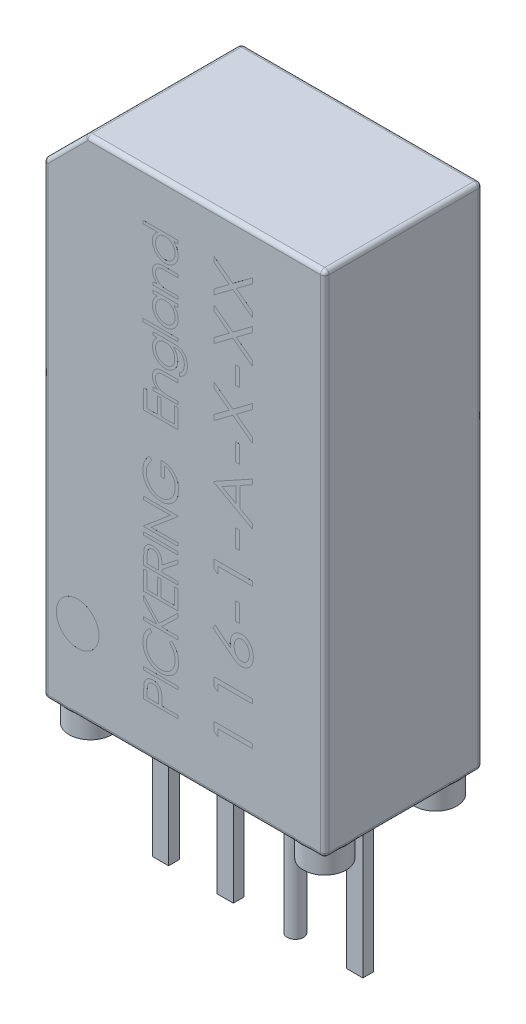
from build123d import *

# Parameters (mm, degrees)
SKETCH1_W           = 6.6
SKETCH1_H           = 3.7
MAIN_BODY_DEPTH     = 11.942
BOX_STYLE_CUT_DEPTH = 13.930249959
SKETCH3_R           = 0.5
FEET_DEPTH          = 0.508
SKETCH4_R           = 0.1905
SKETCH4_W           = 0.381
SKETCH4_H           = 0.254
PINS_DEPTH          = 3.678
SKETCH5_R           = 0.5
SKETCH5_W           = 0.8
SKETCH5_H           = 0.071794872
SKETCH5_W_2         = 0.820512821
SKETCH5_W_3         = 0.092307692
SKETCH5_H_2         = 0.415384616
SKETCH5_H_3         = 0.415384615
LETTERING_DEPTH     = 0.0001
FILLET1_R           = 0.1


with BuildPart() as part:
    # Sketch1 → Main body (new body)
    with BuildSketch(Plane(origin=(0, 0, 0), x_dir=(1, 0, 0), z_dir=(0, 1, 0))):
        Rectangle(SKETCH1_W, SKETCH1_H)
    extrude(amount=MAIN_BODY_DEPTH)

    # Sketch2 → Box style cut (cut, through all)
    with BuildSketch(Plane.XY.offset(1.85)):
        Polygon((-2.3, 11.942), (-3.3, 10.942), (-3.3, 11.942), align=None)
    extrude(amount=-BOX_STYLE_CUT_DEPTH, mode=Mode.SUBTRACT)

    # Sketch3 → Feet (add)
    with BuildSketch(Plane.XZ):
        with Locations(Location((-2.75, 1.3, 0), (0, 0, 90))):
            Circle(SKETCH3_R)
        with Locations(Location((-2.75, -1.3, 0), (0, 0, 90))):
            Circle(SKETCH3_R)
        with Locations(Location((2.75, -1.3, 0), (0, 0, 90))):
            Circle(SKETCH3_R)
        with Locations(Location((2.75, 1.3, 0), (0, 0, 90))):
            Circle(SKETCH3_R)
    extrude(amount=FEET_DEPTH)

    # Sketch4 → Pins (add)
    with BuildSketch(Plane.XZ):
        with Locations(Location((0.76, 0, 0), (0, 0, 90))):
            Circle(SKETCH4_R)
        with Locations((-2.28, 0)):
            Rectangle(SKETCH4_W, SKETCH4_H)
        with Locations((-0.76, 0)):
            Rectangle(SKETCH4_W, SKETCH4_H)
        with Locations((2.28, 0)):
            Rectangle(SKETCH4_W, SKETCH4_H)
    extrude(amount=PINS_DEPTH)

    # Sketch5 → Lettering (add)
    # profile 1 of 29: a face of its own
    with BuildSketch(Plane.XY.offset(1.85)):
        with Locations(Location((-2.5, 1.9, 0), (0, 0, 180))):
            Circle(SKETCH5_R)
    # profile 2 of 29: a face of its own
    with BuildSketch(Plane.XY.offset(1.85)):
        with BuildLine():
            Line((-0.95, 1.144564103), (-0.95, 1.301455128))
            add(Edge.make_bspline(
                [(-0.95, 1.301455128), (-0.949988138, 1.312246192), (-0.94996541, 1.332922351), (-0.949276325, 1.362571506), (-0.948355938, 1.389499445), (-0.947080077, 1.413648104), (-0.945572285, 1.435091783), (-0.943457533, 1.453733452), (-0.941249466, 1.469719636), (-0.939004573, 1.479298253), (-0.937980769, 1.483666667)],
                knots=[0, 0, 0, 0, 1.415646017, 2.712440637, 3.8905458, 4.950247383, 5.884950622, 6.709939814, 7.411656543, 8, 8, 8, 8], degree=3))
            add(Edge.make_bspline(
                [(-0.937980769, 1.483666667), (-0.936467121, 1.489196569), (-0.933475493, 1.500126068), (-0.927484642, 1.515875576), (-0.920376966, 1.530856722), (-0.912291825, 1.54513637), (-0.902831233, 1.558454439), (-0.892624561, 1.571254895), (-0.881012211, 1.583085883), (-0.868360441, 1.594107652), (-0.854829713, 1.604294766), (-0.840174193, 1.612853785), (-0.824831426, 1.620337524), (-0.808592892, 1.626464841), (-0.791442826, 1.631021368), (-0.773503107, 1.634404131), (-0.754753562, 1.636561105), (-0.741939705, 1.636766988), (-0.735416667, 1.636871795)],
                knots=[0, 0, 0, 0, 0.999549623, 1.97554611, 2.93413192, 3.889860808, 4.833293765, 5.780583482, 6.742559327, 7.719844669, 8.705620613, 9.691528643, 10.674968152, 11.680406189, 12.713313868, 13.765869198, 14.862690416, 16, 16, 16, 16], degree=3))
            add(Edge.make_bspline(
                [(-0.735416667, 1.636871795), (-0.728838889, 1.636775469), (-0.715969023, 1.636587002), (-0.697140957, 1.634324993), (-0.679148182, 1.631278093), (-0.662030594, 1.626593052), (-0.645889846, 1.620456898), (-0.630479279, 1.613258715), (-0.616061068, 1.604576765), (-0.60258287, 1.594600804), (-0.590032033, 1.583503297), (-0.578499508, 1.571331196), (-0.568052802, 1.558133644), (-0.558668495, 1.543952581), (-0.550564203, 1.528649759), (-0.54330539, 1.512457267), (-0.537209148, 1.49523436), (-0.534002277, 1.483316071), (-0.532371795, 1.47725641)],
                knots=[0, 0, 0, 0, 1.121902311, 2.195077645, 3.232258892, 4.234102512, 5.217864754, 6.176164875, 7.132989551, 8.084763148, 9.034132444, 9.988522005, 10.94243251, 11.903244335, 12.886203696, 13.894208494, 14.929344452, 16, 16, 16, 16], degree=3))
            add(Edge.make_bspline(
                [(-0.532371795, 1.47725641), (-0.531306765, 1.472244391), (-0.52897269, 1.46126026), (-0.526349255, 1.443171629), (-0.524197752, 1.422100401), (-0.522189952, 1.39811827), (-0.521126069, 1.371169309), (-0.519876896, 1.341315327), (-0.51928748, 1.308455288), (-0.519250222, 1.285536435), (-0.519230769, 1.273570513)],
                knots=[0, 0, 0, 0, 0.601372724, 1.317943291, 2.144091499, 3.08771165, 4.142394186, 5.309582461, 6.595334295, 8, 8, 8, 8], degree=3))
            Line((-0.519230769, 1.273570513), (-0.519230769, 1.216358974))
            Line((-0.519230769, 1.216358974), (-0.15, 1.216358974))
            Line((-0.15, 1.216358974), (-0.15, 1.144564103))
            Line((-0.15, 1.144564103), (-0.95, 1.144564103))
        make_face()
        with BuildLine():
            Line((-0.867948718, 1.216358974), (-0.601282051, 1.216358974))
            Line((-0.601282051, 1.216358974), (-0.599519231, 1.356423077))
            add(Edge.make_bspline(
                [(-0.599519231, 1.356423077), (-0.599515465, 1.363261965), (-0.599508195, 1.376464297), (-0.600422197, 1.395534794), (-0.601463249, 1.413230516), (-0.603037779, 1.42948492), (-0.605101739, 1.444355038), (-0.607668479, 1.457712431), (-0.610458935, 1.469756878), (-0.615121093, 1.483611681), (-0.62228964, 1.499184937), (-0.63272506, 1.516197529), (-0.646243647, 1.530503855), (-0.661400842, 1.542861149), (-0.678217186, 1.552860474), (-0.696304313, 1.559914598), (-0.715394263, 1.564258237), (-0.728449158, 1.564800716), (-0.735096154, 1.565076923)],
                knots=[0, 0, 0, 0, 1.160746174, 2.240796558, 3.240300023, 4.169675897, 5.012224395, 5.787635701, 6.478238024, 7.109103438, 8.265591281, 9.382545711, 10.479929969, 11.588830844, 12.694575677, 13.785760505, 14.872603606, 16, 16, 16, 16], degree=3))
            add(Edge.make_bspline(
                [(-0.735096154, 1.565076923), (-0.741527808, 1.564788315), (-0.75431314, 1.564214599), (-0.773051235, 1.559950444), (-0.790933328, 1.552784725), (-0.807614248, 1.542852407), (-0.82273809, 1.530795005), (-0.83589849, 1.516792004), (-0.846407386, 1.50080758), (-0.853451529, 1.486062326), (-0.857575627, 1.472858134), (-0.860554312, 1.461445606), (-0.862608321, 1.448493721), (-0.864573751, 1.434125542), (-0.866160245, 1.418359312), (-0.867261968, 1.401094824), (-0.867899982, 1.382389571), (-0.867932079, 1.369404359), (-0.867948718, 1.362673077)],
                knots=[0, 0, 0, 0, 1.120540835, 2.227496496, 3.330685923, 4.466139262, 5.598993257, 6.692710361, 7.80064471, 8.921224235, 9.527843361, 10.209888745, 10.975318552, 11.811557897, 12.738105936, 13.73658638, 14.826690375, 16, 16, 16, 16], degree=3))
            Line((-0.867948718, 1.362673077), (-0.867948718, 1.216358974))
        make_face(mode=Mode.SUBTRACT)
    # profile 3 of 29: a face of its own
    with BuildSketch(Plane.XY.offset(1.85)):
        with Locations((-0.55, 1.769179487)):
            Rectangle(SKETCH5_W, SKETCH5_H)
    # profile 4 of 29: a face of its own
    with BuildSketch(Plane.XY.offset(1.85)):
        with BuildLine():
            Line((-0.803205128, 2.650205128), (-0.755128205, 2.587384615))
            add(Edge.make_bspline(
                [(-0.755128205, 2.587384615), (-0.760468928, 2.582903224), (-0.771078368, 2.574000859), (-0.785977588, 2.55967943), (-0.799931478, 2.544750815), (-0.813029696, 2.529235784), (-0.824745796, 2.512775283), (-0.835992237, 2.495996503), (-0.845838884, 2.478289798), (-0.857867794, 2.453929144), (-0.870146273, 2.421936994), (-0.880706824, 2.381803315), (-0.887366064, 2.339849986), (-0.888092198, 2.311234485), (-0.888461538, 2.296679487)],
                knots=[0, 0, 0, 0, 0.75789156, 1.505565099, 2.245254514, 2.979266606, 3.711207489, 4.440978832, 5.174393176, 5.91211879, 7.394186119, 8.890401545, 10.418332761, 12, 12, 12, 12], degree=3))
            add(Edge.make_bspline(
                [(-0.888461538, 2.296679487), (-0.888369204, 2.288660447), (-0.888185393, 2.272696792), (-0.88576045, 2.249005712), (-0.882352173, 2.225757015), (-0.877294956, 2.202965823), (-0.870901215, 2.180661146), (-0.86326112, 2.158697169), (-0.853808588, 2.137391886), (-0.843360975, 2.116450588), (-0.831560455, 2.096386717), (-0.818688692, 2.077402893), (-0.804890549, 2.059567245), (-0.790111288, 2.042869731), (-0.774428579, 2.027278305), (-0.757666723, 2.012989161), (-0.74000491, 1.999811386), (-0.721428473, 1.987820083), (-0.702110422, 1.977025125), (-0.681940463, 1.967948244), (-0.661263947, 1.960020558), (-0.639934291, 1.953648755), (-0.618093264, 1.948644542), (-0.595650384, 1.945184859), (-0.572648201, 1.942788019), (-0.557057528, 1.94260505), (-0.549198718, 1.942512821)],
                knots=[0, 0, 0, 0, 1.054877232, 2.099964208, 3.13098259, 4.145888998, 5.169474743, 6.183358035, 7.203388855, 8.234598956, 9.261847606, 10.264062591, 11.251197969, 12.227332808, 13.196685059, 14.158975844, 15.123498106, 16.094582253, 17.066912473, 18.032714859, 19.002806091, 19.979168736, 20.95977404, 21.949109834, 22.966205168, 24, 24, 24, 24], degree=3))
            add(Edge.make_bspline(
                [(-0.549198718, 1.942512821), (-0.53737468, 1.942801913), (-0.514159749, 1.943369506), (-0.480151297, 1.948399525), (-0.4475399, 1.956104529), (-0.41654637, 1.967463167), (-0.386912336, 1.981748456), (-0.358997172, 1.999572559), (-0.332391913, 2.020294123), (-0.307740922, 2.044125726), (-0.285223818, 2.070276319), (-0.265395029, 2.098332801), (-0.248865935, 2.128226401), (-0.235111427, 2.159626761), (-0.224538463, 2.19277559), (-0.217095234, 2.227613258), (-0.212239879, 2.264064), (-0.211775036, 2.288971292), (-0.211538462, 2.301647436)],
                knots=[0, 0, 0, 0, 1.029159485, 2.020618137, 2.987588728, 3.942669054, 4.889339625, 5.846988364, 6.821327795, 7.821533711, 8.827683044, 9.822769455, 10.807800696, 11.797391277, 12.803701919, 13.832062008, 14.896664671, 16, 16, 16, 16], degree=3))
            add(Edge.make_bspline(
                [(-0.211538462, 2.301647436), (-0.211924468, 2.315613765), (-0.212684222, 2.343102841), (-0.219120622, 2.383415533), (-0.229556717, 2.422006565), (-0.244161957, 2.458878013), (-0.263148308, 2.493925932), (-0.286164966, 2.527205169), (-0.313430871, 2.558743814), (-0.334249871, 2.577708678), (-0.344871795, 2.587384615)],
                knots=[0, 0, 0, 0, 1.028121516, 2.023589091, 2.998037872, 3.967518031, 4.937445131, 5.927275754, 6.942489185, 8, 8, 8, 8], degree=3))
            Line((-0.344871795, 2.587384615), (-0.297275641, 2.650205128))
            add(Edge.make_bspline(
                [(-0.297275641, 2.650205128), (-0.290752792, 2.645149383), (-0.277738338, 2.635062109), (-0.259387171, 2.618731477), (-0.242141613, 2.601515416), (-0.226087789, 2.583369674), (-0.211159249, 2.564262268), (-0.197347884, 2.54419495), (-0.184726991, 2.523184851), (-0.17313408, 2.501398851), (-0.162926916, 2.478786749), (-0.153881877, 2.455547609), (-0.146393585, 2.431538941), (-0.140059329, 2.406962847), (-0.13554272, 2.381597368), (-0.131946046, 2.35573736), (-0.129812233, 2.329140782), (-0.129596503, 2.311213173), (-0.129487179, 2.302128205)],
                knots=[0, 0, 0, 0, 0.986911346, 1.969095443, 2.935967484, 3.900112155, 4.865124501, 5.834589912, 6.812044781, 7.795288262, 8.784678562, 9.777857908, 10.776141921, 11.791195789, 12.811324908, 13.855933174, 14.913475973, 16, 16, 16, 16], degree=3))
            add(Edge.make_bspline(
                [(-0.129487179, 2.302128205), (-0.129547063, 2.293523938), (-0.129665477, 2.276510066), (-0.131583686, 2.251390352), (-0.134200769, 2.22693559), (-0.138141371, 2.203215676), (-0.142791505, 2.180101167), (-0.149024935, 2.157801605), (-0.156007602, 2.136097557), (-0.164214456, 2.115076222), (-0.173475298, 2.094719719), (-0.18394194, 2.075093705), (-0.195526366, 2.056207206), (-0.207973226, 2.037874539), (-0.221682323, 2.02036652), (-0.236463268, 2.003531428), (-0.252266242, 1.987274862), (-0.263661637, 1.977217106), (-0.269391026, 1.972160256)],
                knots=[0, 0, 0, 0, 1.114604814, 2.203992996, 3.262667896, 4.300477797, 5.318619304, 6.316056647, 7.298880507, 8.271930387, 9.238335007, 10.195173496, 11.151986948, 12.108099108, 13.064862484, 14.031167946, 15.010108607, 16, 16, 16, 16], degree=3))
            add(Edge.make_bspline(
                [(-0.269391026, 1.972160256), (-0.279343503, 1.964061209), (-0.299128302, 1.947960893), (-0.331190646, 1.927352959), (-0.364636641, 1.909771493), (-0.399660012, 1.895397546), (-0.436274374, 1.884356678), (-0.474420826, 1.87659423), (-0.51402311, 1.871585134), (-0.540956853, 1.871010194), (-0.554647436, 1.870717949)],
                knots=[0, 0, 0, 0, 0.994611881, 1.977215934, 2.950189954, 3.921972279, 4.908960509, 5.911694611, 6.938501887, 8, 8, 8, 8], degree=3))
            add(Edge.make_bspline(
                [(-0.554647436, 1.870717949), (-0.569037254, 1.871073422), (-0.597348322, 1.871772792), (-0.638896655, 1.877714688), (-0.678702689, 1.88727327), (-0.716692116, 1.900849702), (-0.753064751, 1.918062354), (-0.787542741, 1.93932558), (-0.820346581, 1.964392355), (-0.850978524, 1.993066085), (-0.878987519, 2.024510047), (-0.903628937, 2.058182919), (-0.924135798, 2.094018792), (-0.941277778, 2.131622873), (-0.954453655, 2.171276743), (-0.963677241, 2.212895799), (-0.969418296, 2.256401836), (-0.970144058, 2.286084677), (-0.970512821, 2.301166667)],
                knots=[0, 0, 0, 0, 1.032925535, 2.032216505, 3.007276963, 3.968222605, 4.92396291, 5.891752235, 6.871517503, 7.883894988, 8.900124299, 9.891468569, 10.874487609, 11.85992873, 12.854644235, 13.869047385, 14.917252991, 16, 16, 16, 16], degree=3))
            add(Edge.make_bspline(
                [(-0.970512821, 2.301166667), (-0.970402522, 2.310358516), (-0.970184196, 2.328552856), (-0.968058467, 2.355468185), (-0.964507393, 2.381670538), (-0.959699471, 2.407187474), (-0.953644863, 2.432092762), (-0.946098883, 2.45633981), (-0.937114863, 2.479869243), (-0.926855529, 2.502673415), (-0.915318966, 2.524598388), (-0.902641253, 2.545630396), (-0.888886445, 2.565685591), (-0.873913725, 2.584659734), (-0.857847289, 2.60257604), (-0.840875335, 2.61970028), (-0.822562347, 2.635533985), (-0.809669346, 2.645305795), (-0.803205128, 2.650205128)],
                knots=[0, 0, 0, 0, 1.096622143, 2.170653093, 3.219033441, 4.250379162, 5.267604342, 6.275621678, 7.278284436, 8.271072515, 9.257558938, 10.232633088, 11.19973724, 12.157384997, 13.114417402, 14.069920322, 15.032307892, 16, 16, 16, 16], degree=3))
        make_face()
    # profile 5 of 29: a face of its own
    with BuildSketch(Plane.XY.offset(1.85)):
        Polygon((-0.95, 2.746615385), (-0.95, 2.818410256), (-0.645352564, 2.818410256), (-0.95, 3.151903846), (-0.95, 3.254307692), (-0.591025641, 2.861198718), (-0.15, 3.285076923), (-0.15, 3.189403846), (-0.536057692, 2.818410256), (-0.15, 2.818410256), (-0.15, 2.746615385), align=None)
    # profile 6 of 29: a face of its own
    with BuildSketch(Plane.XY.offset(1.85)):
        Polygon((-0.95, 3.335333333), (-0.95, 3.786615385), (-0.867948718, 3.786615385), (-0.867948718, 3.407128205), (-0.621794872, 3.407128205), (-0.621794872, 3.786615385), (-0.53974359, 3.786615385), (-0.53974359, 3.407128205), (-0.232051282, 3.407128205), (-0.232051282, 3.786615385), (-0.15, 3.786615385), (-0.15, 3.335333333), align=None)
    # profile 7 of 29: a face of its own
    with BuildSketch(Plane.XY.offset(1.85)):
        with BuildLine():
            Line((-0.95, 3.862512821), (-0.95, 4.022608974))
            add(Edge.make_bspline(
                [(-0.95, 4.022608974), (-0.949964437, 4.033292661), (-0.949896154, 4.053806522), (-0.949515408, 4.083194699), (-0.948424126, 4.109898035), (-0.947485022, 4.13390257), (-0.945772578, 4.155207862), (-0.944135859, 4.173879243), (-0.941993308, 4.189830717), (-0.940003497, 4.199486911), (-0.939102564, 4.203858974)],
                knots=[0, 0, 0, 0, 1.410062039, 2.707475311, 3.878576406, 4.937260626, 5.877586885, 6.699081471, 7.410979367, 8, 8, 8, 8], degree=3))
            add(Edge.make_bspline(
                [(-0.939102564, 4.203858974), (-0.937656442, 4.209711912), (-0.934795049, 4.22129293), (-0.928747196, 4.237967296), (-0.921748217, 4.253856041), (-0.913528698, 4.268894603), (-0.904023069, 4.283002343), (-0.893412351, 4.296344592), (-0.881717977, 4.30887804), (-0.868834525, 4.320439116), (-0.855036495, 4.330940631), (-0.840361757, 4.340152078), (-0.824870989, 4.347935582), (-0.808540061, 4.354043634), (-0.791549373, 4.359168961), (-0.773725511, 4.362612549), (-0.755127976, 4.364757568), (-0.742473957, 4.364969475), (-0.736057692, 4.365076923)],
                knots=[0, 0, 0, 0, 1.02737844, 2.032840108, 3.019645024, 3.985760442, 4.950801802, 5.916702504, 6.889791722, 7.870143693, 8.864820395, 9.842884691, 10.820524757, 11.815201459, 12.812418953, 13.84314332, 14.906358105, 16, 16, 16, 16], degree=3))
            add(Edge.make_bspline(
                [(-0.736057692, 4.365076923), (-0.72539824, 4.364741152), (-0.704598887, 4.364085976), (-0.674413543, 4.357977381), (-0.646255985, 4.347971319), (-0.620161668, 4.334183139), (-0.596639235, 4.316624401), (-0.575978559, 4.295521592), (-0.558689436, 4.270862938), (-0.546700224, 4.247907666), (-0.539021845, 4.227630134), (-0.533619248, 4.210936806), (-0.529445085, 4.192727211), (-0.525705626, 4.17317582), (-0.522882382, 4.15220127), (-0.520814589, 4.129853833), (-0.519522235, 4.10611757), (-0.519329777, 4.089811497), (-0.519230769, 4.081423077)],
                knots=[0, 0, 0, 0, 1.260483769, 2.459530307, 3.627416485, 4.787058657, 5.939039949, 7.08810263, 8.267026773, 9.491475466, 10.141966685, 10.831826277, 11.566392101, 12.351337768, 13.187381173, 14.07005841, 15.007169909, 16, 16, 16, 16], degree=3))
            Line((-0.519230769, 4.081423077), (-0.15, 4.375333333))
            Line((-0.15, 4.375333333), (-0.15, 4.286551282))
            Line((-0.15, 4.286551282), (-0.519230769, 3.992641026))
            Line((-0.519230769, 3.992641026), (-0.519230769, 3.934307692))
            Line((-0.519230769, 3.934307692), (-0.15, 3.934307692))
            Line((-0.15, 3.934307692), (-0.15, 3.862512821))
            Line((-0.15, 3.862512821), (-0.95, 3.862512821))
        make_face()
        with BuildLine():
            Line((-0.867948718, 3.934307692), (-0.601282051, 3.934307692))
            Line((-0.601282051, 3.934307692), (-0.600160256, 4.080782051))
            add(Edge.make_bspline(
                [(-0.600160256, 4.080782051), (-0.600157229, 4.087620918), (-0.600151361, 4.10087659), (-0.601064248, 4.120053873), (-0.60210264, 4.137909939), (-0.603691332, 4.15437626), (-0.605737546, 4.169460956), (-0.608301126, 4.183153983), (-0.611275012, 4.195485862), (-0.615925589, 4.209821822), (-0.622971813, 4.226019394), (-0.633915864, 4.243237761), (-0.647065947, 4.258345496), (-0.662537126, 4.270649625), (-0.679277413, 4.280958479), (-0.697458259, 4.287895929), (-0.716489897, 4.292519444), (-0.729566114, 4.293024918), (-0.736217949, 4.293282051)],
                knots=[0, 0, 0, 0, 1.146477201, 2.22219935, 3.21835465, 4.145220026, 4.995151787, 5.769831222, 6.480173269, 7.120302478, 8.295254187, 9.430763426, 10.528629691, 11.636497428, 12.733230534, 13.811001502, 14.886462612, 16, 16, 16, 16], degree=3))
            add(Edge.make_bspline(
                [(-0.736217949, 4.293282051), (-0.742650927, 4.293006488), (-0.755398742, 4.292460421), (-0.774070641, 4.288026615), (-0.791698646, 4.28044658), (-0.808305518, 4.27047501), (-0.823144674, 4.257960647), (-0.835979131, 4.243568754), (-0.846485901, 4.227302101), (-0.853469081, 4.212232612), (-0.857569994, 4.198655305), (-0.860550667, 4.186922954), (-0.862619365, 4.173601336), (-0.864578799, 4.158751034), (-0.866165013, 4.142343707), (-0.867259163, 4.124331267), (-0.867899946, 4.104825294), (-0.867932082, 4.091306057), (-0.867948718, 4.084307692)],
                knots=[0, 0, 0, 0, 1.100823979, 2.181431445, 3.263702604, 4.376021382, 5.48638238, 6.575013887, 7.666064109, 8.791843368, 9.405226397, 10.093019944, 10.863016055, 11.711746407, 12.658404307, 13.684961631, 14.801597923, 16, 16, 16, 16], degree=3))
            Line((-0.867948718, 4.084307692), (-0.867948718, 3.934307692))
        make_face(mode=Mode.SUBTRACT)
    # profile 8 of 29: a face of its own
    with BuildSketch(Plane.XY.offset(1.85)):
        with Locations((-0.55, 4.507641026)):
            Rectangle(SKETCH5_W, SKETCH5_H)
    # profile 9 of 29: a face of its own
    with BuildSketch(Plane.XY.offset(1.85)):
        Polygon((-0.15, 4.650205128), (-0.95, 4.650205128), (-0.95, 4.665269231), (-0.320352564, 5.193794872), (-0.95, 5.193794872), (-0.95, 5.265589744), (-0.15, 5.265589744), (-0.15, 5.24924359), (-0.778205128, 4.722), (-0.15, 4.722), align=None)
    # profile 10 of 29: a face of its own
    with BuildSketch(Plane.XY.offset(1.85)):
        with BuildLine():
            Line((-0.813461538, 6.15174359), (-0.755128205, 6.090205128))
            add(Edge.make_bspline(
                [(-0.755128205, 6.090205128), (-0.765607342, 6.079071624), (-0.786315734, 6.057070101), (-0.813141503, 6.021138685), (-0.836349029, 5.983800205), (-0.855090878, 5.944994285), (-0.869792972, 5.905738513), (-0.88048005, 5.866707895), (-0.887248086, 5.828155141), (-0.888060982, 5.802517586), (-0.888461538, 5.789884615)],
                knots=[0, 0, 0, 0, 1.089067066, 2.152164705, 3.18986567, 4.218445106, 5.218487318, 6.173592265, 7.100032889, 8, 8, 8, 8], degree=3))
            add(Edge.make_bspline(
                [(-0.888461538, 5.789884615), (-0.888367, 5.782132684), (-0.888178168, 5.766648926), (-0.885768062, 5.743649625), (-0.882301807, 5.720891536), (-0.877286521, 5.698417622), (-0.870930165, 5.676184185), (-0.862979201, 5.654268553), (-0.853709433, 5.63262984), (-0.842998, 5.611471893), (-0.831231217, 5.590959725), (-0.818191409, 5.571586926), (-0.804297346, 5.553228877), (-0.789198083, 5.536234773), (-0.773041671, 5.52049157), (-0.756119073, 5.505709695), (-0.738097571, 5.492164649), (-0.719051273, 5.48009936), (-0.699423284, 5.46920391), (-0.679380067, 5.45978855), (-0.65910769, 5.451603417), (-0.638453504, 5.445369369), (-0.617630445, 5.440089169), (-0.596529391, 5.436413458), (-0.575095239, 5.4343343), (-0.560741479, 5.433975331), (-0.553525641, 5.433794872)],
                knots=[0, 0, 0, 0, 1.028150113, 2.053633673, 3.06513288, 4.081487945, 5.106702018, 6.131327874, 7.172780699, 8.228344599, 9.276313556, 10.308389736, 11.324843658, 12.329040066, 13.321460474, 14.316307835, 15.308626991, 16.309440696, 17.305625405, 18.28535951, 19.246194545, 20.203493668, 21.145557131, 22.095268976, 23.042464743, 24, 24, 24, 24], degree=3))
            add(Edge.make_bspline(
                [(-0.553525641, 5.433794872), (-0.54614949, 5.433967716), (-0.531417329, 5.434312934), (-0.50942958, 5.436519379), (-0.487770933, 5.440623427), (-0.466407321, 5.446066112), (-0.445296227, 5.452985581), (-0.424459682, 5.461486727), (-0.403899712, 5.471613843), (-0.383820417, 5.483310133), (-0.36427753, 5.496226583), (-0.345714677, 5.510432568), (-0.328347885, 5.525952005), (-0.311923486, 5.542500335), (-0.296545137, 5.560228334), (-0.282398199, 5.579307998), (-0.269263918, 5.599472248), (-0.257286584, 5.620730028), (-0.246587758, 5.642856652), (-0.237073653, 5.665543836), (-0.229238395, 5.6888645), (-0.222852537, 5.712695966), (-0.217618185, 5.737009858), (-0.21425076, 5.761929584), (-0.211807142, 5.787271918), (-0.211628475, 5.804355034), (-0.211538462, 5.812961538)],
                knots=[0, 0, 0, 0, 0.935915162, 1.869274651, 2.799799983, 3.730201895, 4.664668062, 5.616159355, 6.583070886, 7.570012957, 8.562524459, 9.553461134, 10.53281078, 11.515274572, 12.509912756, 13.507571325, 14.526460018, 15.561318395, 16.601025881, 17.643204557, 18.680545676, 19.719612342, 20.772381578, 21.833430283, 22.908478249, 24, 24, 24, 24], degree=3))
            add(Edge.make_bspline(
                [(-0.211538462, 5.812961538), (-0.211755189, 5.823333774), (-0.212180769, 5.843701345), (-0.215496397, 5.873640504), (-0.220668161, 5.902397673), (-0.228265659, 5.929879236), (-0.237882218, 5.956184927), (-0.249774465, 5.981217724), (-0.263817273, 6.005046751), (-0.279726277, 6.027568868), (-0.297451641, 6.048248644), (-0.316408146, 6.06706969), (-0.336841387, 6.083384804), (-0.358446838, 6.097681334), (-0.38143116, 6.109497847), (-0.405666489, 6.119199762), (-0.43116782, 6.126635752), (-0.448788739, 6.129688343), (-0.457692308, 6.131230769)],
                knots=[0, 0, 0, 0, 1.130199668, 2.219330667, 3.279027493, 4.311506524, 5.322739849, 6.327972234, 7.327472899, 8.33386792, 9.329086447, 10.29244429, 11.240784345, 12.174119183, 13.111530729, 14.052100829, 15.015757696, 16, 16, 16, 16], degree=3))
            Line((-0.457692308, 6.131230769), (-0.457692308, 5.864564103))
            Line((-0.457692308, 5.864564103), (-0.53974359, 5.864564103))
            Line((-0.53974359, 5.864564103), (-0.53974359, 6.203025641))
            add(Edge.make_bspline(
                [(-0.53974359, 6.203025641), (-0.524450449, 6.202635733), (-0.494519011, 6.201872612), (-0.450868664, 6.196519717), (-0.409640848, 6.187875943), (-0.370792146, 6.176067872), (-0.334377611, 6.160782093), (-0.30036027, 6.142182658), (-0.268959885, 6.119971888), (-0.239920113, 6.09494093), (-0.214016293, 6.066849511), (-0.191249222, 6.036456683), (-0.172071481, 6.003712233), (-0.156469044, 5.968647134), (-0.144292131, 5.931376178), (-0.135658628, 5.89181312), (-0.130486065, 5.850011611), (-0.129825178, 5.821363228), (-0.129487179, 5.806711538)],
                knots=[0, 0, 0, 0, 1.140356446, 2.231883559, 3.274166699, 4.278491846, 5.25512956, 6.21435461, 7.1637429, 8.11826594, 9.068280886, 10.0076534, 10.945064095, 11.891975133, 12.864533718, 13.863980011, 14.907571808, 16, 16, 16, 16], degree=3))
            add(Edge.make_bspline(
                [(-0.129487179, 5.806711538), (-0.129617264, 5.79768065), (-0.129873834, 5.779868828), (-0.131697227, 5.753562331), (-0.134504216, 5.72798116), (-0.138743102, 5.703129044), (-0.143935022, 5.678914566), (-0.150583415, 5.655458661), (-0.158279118, 5.632671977), (-0.167032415, 5.610519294), (-0.177174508, 5.589201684), (-0.188445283, 5.568624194), (-0.200786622, 5.548673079), (-0.214411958, 5.529484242), (-0.229219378, 5.5109577), (-0.245238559, 5.493212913), (-0.262420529, 5.47615054), (-0.274621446, 5.465462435), (-0.280769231, 5.460076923)],
                knots=[0, 0, 0, 0, 1.107784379, 2.184907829, 3.233506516, 4.263428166, 5.276301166, 6.270063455, 7.25232949, 8.225834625, 9.190232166, 10.146266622, 11.1027726, 12.066435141, 13.031522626, 14.010570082, 14.99756817, 16, 16, 16, 16], degree=3))
            add(Edge.make_bspline(
                [(-0.280769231, 5.460076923), (-0.290522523, 5.452262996), (-0.309867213, 5.436764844), (-0.340861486, 5.416815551), (-0.372953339, 5.399809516), (-0.406232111, 5.386011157), (-0.440666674, 5.375236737), (-0.476213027, 5.367509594), (-0.512916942, 5.362982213), (-0.537754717, 5.362329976), (-0.550320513, 5.362)],
                knots=[0, 0, 0, 0, 1.023165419, 2.029347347, 3.013907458, 3.994755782, 4.975994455, 5.96558838, 6.970761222, 8, 8, 8, 8], degree=3))
            add(Edge.make_bspline(
                [(-0.550320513, 5.362), (-0.559729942, 5.362121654), (-0.578429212, 5.362363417), (-0.606190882, 5.365294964), (-0.633459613, 5.369501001), (-0.660213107, 5.37568319), (-0.68646926, 5.383476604), (-0.712240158, 5.393203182), (-0.737541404, 5.404527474), (-0.762197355, 5.417690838), (-0.78588641, 5.432335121), (-0.808492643, 5.448245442), (-0.829649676, 5.46554457), (-0.849406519, 5.484282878), (-0.868055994, 5.504082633), (-0.885208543, 5.525359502), (-0.901132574, 5.547791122), (-0.915522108, 5.571551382), (-0.928451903, 5.596265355), (-0.939786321, 5.621879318), (-0.949154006, 5.648383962), (-0.957102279, 5.675581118), (-0.962980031, 5.703676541), (-0.9672426, 5.73246638), (-0.970159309, 5.762100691), (-0.970393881, 5.782131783), (-0.970512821, 5.792288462)],
                knots=[0, 0, 0, 0, 1.00895651, 2.005089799, 2.991467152, 3.967318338, 4.948153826, 5.927364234, 6.919980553, 7.91976625, 8.923240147, 9.905815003, 10.88314567, 11.851989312, 12.825009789, 13.798721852, 14.781296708, 15.773896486, 16.776076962, 17.771600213, 18.775744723, 19.78957137, 20.808953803, 21.851964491, 22.910847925, 24, 24, 24, 24], degree=3))
            add(Edge.make_bspline(
                [(-0.970512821, 5.792288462), (-0.970380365, 5.800571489), (-0.970117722, 5.816995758), (-0.968297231, 5.841435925), (-0.965411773, 5.865498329), (-0.961474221, 5.889218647), (-0.956111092, 5.912516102), (-0.949693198, 5.935457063), (-0.942220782, 5.958074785), (-0.933309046, 5.980298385), (-0.923193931, 6.002277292), (-0.911808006, 6.024133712), (-0.898956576, 6.045792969), (-0.884601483, 6.067292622), (-0.868989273, 6.088768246), (-0.851673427, 6.109880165), (-0.833336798, 6.13113798), (-0.820152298, 6.144806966), (-0.813461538, 6.15174359)],
                knots=[0, 0, 0, 0, 0.985871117, 1.954866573, 2.915460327, 3.869826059, 4.81536089, 5.759505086, 6.70452669, 7.649098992, 8.607881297, 9.583363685, 10.581137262, 11.603961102, 12.659522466, 13.73993555, 14.853081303, 16, 16, 16, 16], degree=3))
        make_face()
    # profile 11 of 29: a face of its own
    with BuildSketch(Plane.XY.offset(1.85)):
        Polygon((-0.95, 7.019435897), (-0.95, 7.470717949), (-0.867948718, 7.470717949), (-0.867948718, 7.091230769), (-0.621794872, 7.091230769), (-0.621794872, 7.470717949), (-0.53974359, 7.470717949), (-0.53974359, 7.091230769), (-0.232051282, 7.091230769), (-0.232051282, 7.470717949), (-0.15, 7.470717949), (-0.15, 7.019435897), align=None)
    # profile 12 of 29: a face of its own
    with BuildSketch(Plane.XY.offset(1.85)):
        with BuildLine():
            Line((-0.734615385, 7.526102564), (-0.734615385, 7.597897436))
            Line((-0.734615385, 7.597897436), (-0.629166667, 7.597897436))
            add(Edge.make_bspline(
                [(-0.629166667, 7.597897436), (-0.638745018, 7.605549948), (-0.657302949, 7.620376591), (-0.681502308, 7.645322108), (-0.70180944, 7.67133286), (-0.717798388, 7.698831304), (-0.729890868, 7.727534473), (-0.738610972, 7.757360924), (-0.74384274, 7.788472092), (-0.744526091, 7.809629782), (-0.744871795, 7.820333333)],
                knots=[0, 0, 0, 0, 1.127869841, 2.185233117, 3.191641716, 4.159226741, 5.10472073, 6.052603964, 7.014823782, 8, 8, 8, 8], degree=3))
            add(Edge.make_bspline(
                [(-0.744871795, 7.820333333), (-0.744496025, 7.831157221), (-0.743760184, 7.852352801), (-0.737257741, 7.8830974), (-0.727027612, 7.911987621), (-0.712501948, 7.938597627), (-0.694563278, 7.962641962), (-0.673633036, 7.983683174), (-0.649684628, 8.001228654), (-0.627336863, 8.012956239), (-0.607477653, 8.020534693), (-0.59049287, 8.025516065), (-0.571561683, 8.029545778), (-0.550731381, 8.033156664), (-0.527918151, 8.035565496), (-0.503176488, 8.037474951), (-0.476510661, 8.038840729), (-0.458068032, 8.03889506), (-0.448557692, 8.038923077)],
                knots=[0, 0, 0, 0, 1.235846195, 2.420061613, 3.574938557, 4.72781258, 5.870749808, 6.993217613, 8.10690044, 9.251157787, 9.865716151, 10.534141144, 11.271861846, 12.076851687, 12.949307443, 13.892392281, 14.913166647, 16, 16, 16, 16], degree=3))
            Line((-0.448557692, 8.038923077), (-0.15, 8.038923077))
            Line((-0.15, 8.038923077), (-0.15, 7.967128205))
            Line((-0.15, 7.967128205), (-0.425, 7.967128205))
            add(Edge.make_bspline(
                [(-0.425, 7.967128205), (-0.432959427, 7.967084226), (-0.448184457, 7.967000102), (-0.469982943, 7.966731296), (-0.489698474, 7.966098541), (-0.507387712, 7.965172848), (-0.522985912, 7.963877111), (-0.53657203, 7.962490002), (-0.548025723, 7.960807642), (-0.55492059, 7.959307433), (-0.558012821, 7.958634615)],
                knots=[0, 0, 0, 0, 1.430803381, 2.736883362, 3.918614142, 4.976458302, 5.92063272, 6.731858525, 7.431260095, 8, 8, 8, 8], degree=3))
            add(Edge.make_bspline(
                [(-0.558012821, 7.958634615), (-0.567096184, 7.956217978), (-0.584532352, 7.951579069), (-0.608142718, 7.939883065), (-0.628407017, 7.92545617), (-0.644908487, 7.907581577), (-0.657754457, 7.886739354), (-0.666660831, 7.862894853), (-0.672233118, 7.836294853), (-0.672787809, 7.817585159), (-0.673076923, 7.807833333)],
                knots=[0, 0, 0, 0, 1.084232, 2.08126119, 3.027460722, 3.945137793, 4.874029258, 5.839697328, 6.874011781, 8, 8, 8, 8], degree=3))
            add(Edge.make_bspline(
                [(-0.673076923, 7.807833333), (-0.672969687, 7.802057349), (-0.67275747, 7.790626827), (-0.670574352, 7.773685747), (-0.667123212, 7.757202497), (-0.662037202, 7.741214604), (-0.655794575, 7.725670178), (-0.64828448, 7.710460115), (-0.63903933, 7.695935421), (-0.628703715, 7.681857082), (-0.61725874, 7.668756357), (-0.605179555, 7.656567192), (-0.592316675, 7.645701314), (-0.578876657, 7.635857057), (-0.564675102, 7.627359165), (-0.549848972, 7.619941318), (-0.534378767, 7.613647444), (-0.52364161, 7.610519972), (-0.518269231, 7.608955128)],
                knots=[0, 0, 0, 0, 1.023827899, 2.026128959, 3.023898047, 4.006668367, 4.997079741, 5.992687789, 7.009920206, 8.046337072, 9.087246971, 10.092051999, 11.086713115, 12.070168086, 13.043348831, 14.017773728, 15.008185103, 16, 16, 16, 16], degree=3))
            add(Edge.make_bspline(
                [(-0.518269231, 7.608955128), (-0.514325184, 7.608054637), (-0.505739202, 7.606094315), (-0.491649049, 7.603977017), (-0.475349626, 7.602055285), (-0.456859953, 7.600446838), (-0.436115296, 7.599462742), (-0.413204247, 7.598389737), (-0.38803545, 7.597999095), (-0.370512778, 7.597932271), (-0.361378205, 7.597897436)],
                knots=[0, 0, 0, 0, 0.615963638, 1.340920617, 2.168419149, 3.115676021, 4.16674242, 5.331190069, 6.6087489, 8, 8, 8, 8], degree=3))
            Line((-0.361378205, 7.597897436), (-0.15, 7.597897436))
            Line((-0.15, 7.597897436), (-0.15, 7.526102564))
            Line((-0.15, 7.526102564), (-0.734615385, 7.526102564))
        make_face()
    # profile 13 of 29: a face of its own
    with BuildSketch(Plane.XY.offset(1.85)):
        with BuildLine():
            Line((-0.734615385, 8.648153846), (-0.734615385, 8.719948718))
            Line((-0.734615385, 8.719948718), (-0.270673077, 8.719948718))
            add(Edge.make_bspline(
                [(-0.270673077, 8.719948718), (-0.260790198, 8.719885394), (-0.241713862, 8.719763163), (-0.214130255, 8.718882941), (-0.188652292, 8.717026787), (-0.165163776, 8.714921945), (-0.14377358, 8.711894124), (-0.124417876, 8.708196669), (-0.10707809, 8.704028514), (-0.096398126, 8.70036675), (-0.091346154, 8.698634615)],
                knots=[0, 0, 0, 0, 1.307562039, 2.523909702, 3.650326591, 4.686913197, 5.643429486, 6.506965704, 7.293745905, 8, 8, 8, 8], degree=3))
            add(Edge.make_bspline(
                [(-0.091346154, 8.698634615), (-0.08477933, 8.696077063), (-0.071842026, 8.691038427), (-0.053502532, 8.681601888), (-0.036235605, 8.67103348), (-0.020132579, 8.658965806), (-0.005292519, 8.645438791), (0.008652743, 8.630849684), (0.021178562, 8.614686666), (0.032435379, 8.597232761), (0.042772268, 8.578840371), (0.051591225, 8.559371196), (0.058946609, 8.538929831), (0.064998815, 8.517610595), (0.069881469, 8.495414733), (0.073139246, 8.47226836), (0.07533289, 8.448249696), (0.075537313, 8.431919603), (0.075641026, 8.423634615)],
                knots=[0, 0, 0, 0, 0.98202571, 1.934689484, 2.871054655, 3.802072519, 4.735470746, 5.668036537, 6.612630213, 7.581518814, 8.561763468, 9.551722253, 10.55777311, 11.588015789, 12.63986657, 13.723744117, 14.845153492, 16, 16, 16, 16], degree=3))
            add(Edge.make_bspline(
                [(0.075641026, 8.423634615), (0.075420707, 8.411550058), (0.07499048, 8.387951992), (0.070878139, 8.353476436), (0.064244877, 8.320841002), (0.054794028, 8.290283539), (0.043107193, 8.262111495), (0.029719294, 8.2364822), (0.014360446, 8.213631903), (-0.003125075, 8.193032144), (-0.023916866, 8.174439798), (-0.048419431, 8.156947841), (-0.077006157, 8.140111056), (-0.097987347, 8.130243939), (-0.108974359, 8.125076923)],
                knots=[0, 0, 0, 0, 1.157856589, 2.260999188, 3.322382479, 4.345906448, 5.321474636, 6.242187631, 7.112686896, 7.955149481, 8.825136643, 9.778649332, 10.836767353, 12, 12, 12, 12], degree=3))
            Line((-0.108974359, 8.125076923), (-0.108974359, 8.196871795))
            add(Edge.make_bspline(
                [(-0.108974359, 8.196871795), (-0.099810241, 8.202648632), (-0.081895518, 8.213941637), (-0.058676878, 8.234989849), (-0.039016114, 8.258226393), (-0.023063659, 8.2841443), (-0.0107829, 8.312924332), (-0.002252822, 8.344752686), (0.002907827, 8.379716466), (0.003524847, 8.404064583), (0.003846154, 8.41674359)],
                knots=[0, 0, 0, 0, 0.997887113, 1.950746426, 2.877762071, 3.798308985, 4.747694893, 5.754452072, 6.830656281, 8, 8, 8, 8], degree=3))
            add(Edge.make_bspline(
                [(0.003846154, 8.41674359), (0.00352063, 8.429262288), (0.002893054, 8.453397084), (-0.002254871, 8.488093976), (-0.010785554, 8.51981851), (-0.023038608, 8.548220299), (-0.037756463, 8.57312265), (-0.054034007, 8.59471357), (-0.072606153, 8.612062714), (-0.089689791, 8.623776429), (-0.104919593, 8.631051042), (-0.118027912, 8.635687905), (-0.132803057, 8.63942748), (-0.149280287, 8.642637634), (-0.167465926, 8.645181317), (-0.187421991, 8.64685023), (-0.209013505, 8.648034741), (-0.223983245, 8.648113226), (-0.231730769, 8.648153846)],
                knots=[0, 0, 0, 0, 1.570880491, 3.028500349, 4.391799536, 5.683507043, 6.897971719, 8.016608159, 9.065046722, 10.074948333, 10.602832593, 11.179761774, 11.817338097, 12.514350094, 13.286299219, 14.121078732, 15.027572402, 16, 16, 16, 16], degree=3))
            Line((-0.231730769, 8.648153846), (-0.262019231, 8.648153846))
            add(Edge.make_bspline(
                [(-0.262019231, 8.648153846), (-0.253350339, 8.64086428), (-0.236165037, 8.626413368), (-0.21360589, 8.601524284), (-0.194411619, 8.574167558), (-0.178445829, 8.544729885), (-0.165796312, 8.513649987), (-0.156630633, 8.48147736), (-0.150945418, 8.448302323), (-0.150317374, 8.42584735), (-0.15, 8.4145)],
                knots=[0, 0, 0, 0, 1.012670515, 2.007528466, 2.995541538, 3.996581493, 4.997861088, 5.991949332, 6.98525577, 8, 8, 8, 8], degree=3))
            add(Edge.make_bspline(
                [(-0.15, 8.4145), (-0.150140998, 8.407819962), (-0.15042122, 8.394543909), (-0.152125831, 8.37476476), (-0.155445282, 8.355366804), (-0.159695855, 8.336226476), (-0.16539363, 8.317477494), (-0.172080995, 8.298895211), (-0.180294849, 8.280749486), (-0.189542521, 8.262947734), (-0.199932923, 8.245908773), (-0.211158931, 8.229686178), (-0.223196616, 8.214379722), (-0.236155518, 8.200131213), (-0.250019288, 8.186960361), (-0.264639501, 8.174689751), (-0.280220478, 8.16352236), (-0.296478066, 8.153229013), (-0.313520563, 8.144301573), (-0.330978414, 8.136465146), (-0.348814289, 8.129651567), (-0.367087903, 8.124219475), (-0.385787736, 8.12007065), (-0.404883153, 8.116982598), (-0.424432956, 8.11523107), (-0.43760355, 8.114957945), (-0.444230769, 8.114820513)],
                knots=[0, 0, 0, 0, 1.028710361, 2.044481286, 3.053267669, 4.056977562, 5.061496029, 6.068537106, 7.095799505, 8.125955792, 9.155750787, 10.166547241, 11.162135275, 12.151998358, 13.129411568, 14.10464185, 15.088574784, 16.079052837, 17.065149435, 18.048153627, 19.024354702, 20.002874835, 20.980703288, 21.971932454, 22.97951087, 24, 24, 24, 24], degree=3))
            add(Edge.make_bspline(
                [(-0.444230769, 8.114820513), (-0.450860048, 8.114939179), (-0.46409293, 8.115176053), (-0.483722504, 8.117221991), (-0.503089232, 8.120140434), (-0.521993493, 8.124759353), (-0.540650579, 8.130318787), (-0.558922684, 8.137204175), (-0.576815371, 8.145482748), (-0.594341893, 8.154856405), (-0.611267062, 8.165389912), (-0.627341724, 8.176940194), (-0.642447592, 8.189521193), (-0.65673706, 8.202959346), (-0.670072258, 8.217418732), (-0.682420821, 8.232891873), (-0.693989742, 8.249226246), (-0.704529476, 8.266472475), (-0.713851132, 8.284364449), (-0.722356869, 8.302447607), (-0.729107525, 8.32096149), (-0.735055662, 8.339560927), (-0.73926942, 8.358573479), (-0.742520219, 8.377766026), (-0.744500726, 8.397204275), (-0.744747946, 8.41022208), (-0.744871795, 8.41674359)],
                knots=[0, 0, 0, 0, 1.008818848, 2.013730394, 3.001654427, 3.987803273, 4.973046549, 5.963777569, 6.957074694, 7.972068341, 8.987420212, 9.989399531, 10.982630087, 11.977756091, 12.973280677, 13.973972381, 14.989194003, 16.018387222, 17.047741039, 18.059210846, 19.057554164, 20.045176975, 21.029480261, 22.018708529, 23.007435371, 24, 24, 24, 24], degree=3))
            add(Edge.make_bspline(
                [(-0.744871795, 8.41674359), (-0.744561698, 8.42749809), (-0.743949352, 8.448734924), (-0.739144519, 8.479987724), (-0.731484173, 8.510145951), (-0.720509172, 8.539379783), (-0.705526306, 8.56792736), (-0.685790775, 8.595694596), (-0.661125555, 8.622761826), (-0.642210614, 8.63946533), (-0.632371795, 8.648153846)],
                knots=[0, 0, 0, 0, 0.96728863, 1.910097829, 2.838038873, 3.762875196, 4.71315279, 5.730631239, 6.819562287, 8, 8, 8, 8], degree=3))
            Line((-0.632371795, 8.648153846), (-0.734615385, 8.648153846))
        make_face()
        with BuildLine():
            add(Edge.make_bspline(
                [(-0.673076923, 8.422512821), (-0.672718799, 8.412015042), (-0.672009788, 8.391231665), (-0.665998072, 8.360756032), (-0.656482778, 8.331402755), (-0.643238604, 8.30346126), (-0.626500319, 8.277575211), (-0.606586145, 8.254409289), (-0.583769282, 8.234211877), (-0.558343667, 8.217121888), (-0.530870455, 8.203469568), (-0.501924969, 8.193932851), (-0.47201284, 8.187629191), (-0.451634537, 8.186955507), (-0.441346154, 8.186615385)],
                knots=[0, 0, 0, 0, 1.026191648, 2.031641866, 3.026511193, 4.038688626, 5.047555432, 6.033268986, 7.01798463, 8.019529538, 9.022150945, 10.008736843, 10.994672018, 12, 12, 12, 12], degree=3))
            add(Edge.make_bspline(
                [(-0.441346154, 8.186615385), (-0.433590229, 8.186781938), (-0.418336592, 8.187109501), (-0.395947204, 8.190236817), (-0.374589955, 8.195353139), (-0.354285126, 8.202421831), (-0.335030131, 8.211454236), (-0.316826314, 8.222594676), (-0.299663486, 8.235780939), (-0.28368647, 8.250831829), (-0.269135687, 8.267421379), (-0.25634977, 8.285414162), (-0.245892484, 8.304786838), (-0.236854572, 8.325062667), (-0.230253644, 8.346733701), (-0.225216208, 8.369487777), (-0.222334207, 8.393485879), (-0.221976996, 8.409845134), (-0.221794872, 8.418185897)],
                knots=[0, 0, 0, 0, 1.039710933, 2.044807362, 3.024849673, 3.981007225, 4.923240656, 5.871799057, 6.837597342, 7.820855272, 8.810901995, 9.792827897, 10.773995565, 11.758948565, 12.765014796, 13.806304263, 14.881544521, 16, 16, 16, 16], degree=3))
            add(Edge.make_bspline(
                [(-0.221794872, 8.418185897), (-0.221970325, 8.426634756), (-0.222313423, 8.443156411), (-0.225262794, 8.46728691), (-0.230022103, 8.490151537), (-0.236779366, 8.511729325), (-0.24540148, 8.532101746), (-0.256312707, 8.551039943), (-0.268738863, 8.568949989), (-0.283233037, 8.585260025), (-0.299206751, 8.600008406), (-0.316588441, 8.612861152), (-0.33511656, 8.623813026), (-0.354789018, 8.632882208), (-0.375758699, 8.639805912), (-0.39797318, 8.644450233), (-0.421326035, 8.647697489), (-0.437328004, 8.647999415), (-0.445512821, 8.648153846)],
                knots=[0, 0, 0, 0, 1.121943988, 2.193949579, 3.223793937, 4.220241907, 5.192961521, 6.155822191, 7.11847367, 8.083710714, 9.04790392, 10.001595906, 10.949595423, 11.902125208, 12.873731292, 13.87582262, 14.913508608, 16, 16, 16, 16], degree=3))
            add(Edge.make_bspline(
                [(-0.445512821, 8.648153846), (-0.456168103, 8.64784711), (-0.476984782, 8.647247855), (-0.507320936, 8.641610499), (-0.535873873, 8.632465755), (-0.562570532, 8.619774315), (-0.587039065, 8.603797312), (-0.608659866, 8.584365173), (-0.628029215, 8.562337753), (-0.643955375, 8.537176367), (-0.656936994, 8.510244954), (-0.66636022, 8.481940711), (-0.67190755, 8.452537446), (-0.672684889, 8.432578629), (-0.673076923, 8.422512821)],
                knots=[0, 0, 0, 0, 1.070678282, 2.091729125, 3.090678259, 4.078281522, 5.055707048, 6.018451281, 6.993304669, 7.996175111, 9.002951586, 9.993356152, 10.987991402, 12, 12, 12, 12], degree=3))
        make_face(mode=Mode.SUBTRACT)
    # profile 14 of 29: a face of its own
    with BuildSketch(Plane.XY.offset(1.85)):
        with Locations((-0.560256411, 8.842)):
            Rectangle(SKETCH5_W_2, SKETCH5_H)
    # profile 15 of 29: a face of its own
    with BuildSketch(Plane.XY.offset(1.85)):
        with BuildLine():
            Line((-0.734615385, 9.569179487), (-0.15, 9.569179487))
            Line((-0.15, 9.569179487), (-0.15, 9.497384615))
            Line((-0.15, 9.497384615), (-0.251121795, 9.497384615))
            add(Edge.make_bspline(
                [(-0.251121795, 9.497384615), (-0.241984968, 9.489276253), (-0.224127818, 9.473429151), (-0.200584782, 9.447210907), (-0.181521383, 9.419074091), (-0.165901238, 9.389724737), (-0.154215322, 9.358875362), (-0.145894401, 9.326687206), (-0.140548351, 9.293129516), (-0.14001425, 9.270214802), (-0.13974359, 9.258602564)],
                knots=[0, 0, 0, 0, 1.074325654, 2.099677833, 3.090439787, 4.057542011, 5.018572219, 5.985274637, 6.979019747, 8, 8, 8, 8], degree=3))
            add(Edge.make_bspline(
                [(-0.13974359, 9.258602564), (-0.140023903, 9.24827846), (-0.140576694, 9.227918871), (-0.144865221, 9.197969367), (-0.15175222, 9.169148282), (-0.161329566, 9.141428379), (-0.174033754, 9.114989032), (-0.189243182, 9.089603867), (-0.207355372, 9.065404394), (-0.228061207, 9.042759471), (-0.25055149, 9.021906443), (-0.274539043, 9.003606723), (-0.299920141, 8.988348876), (-0.326373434, 8.975590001), (-0.354102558, 8.965762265), (-0.383011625, 8.958911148), (-0.413066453, 8.954627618), (-0.43353263, 8.954075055), (-0.443910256, 8.953794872)],
                knots=[0, 0, 0, 0, 1.033919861, 2.038935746, 3.024066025, 3.998881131, 4.97069526, 5.957263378, 6.95902576, 7.993208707, 9.027059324, 10.027763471, 11.009749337, 11.988697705, 12.965288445, 13.950418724, 14.960734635, 16, 16, 16, 16], degree=3))
            add(Edge.make_bspline(
                [(-0.443910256, 8.953794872), (-0.454073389, 8.954081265), (-0.474165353, 8.95464745), (-0.50371477, 8.958865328), (-0.532176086, 8.96595813), (-0.559457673, 8.975911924), (-0.585592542, 8.9886758), (-0.610599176, 9.00420222), (-0.634546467, 9.022492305), (-0.656871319, 9.04357857), (-0.677493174, 9.066420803), (-0.695415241, 9.090857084), (-0.710893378, 9.116279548), (-0.72315703, 9.143082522), (-0.733079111, 9.170869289), (-0.739943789, 9.19988722), (-0.743988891, 9.23001558), (-0.744574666, 9.25047055), (-0.744871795, 9.260846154)],
                knots=[0, 0, 0, 0, 1.020392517, 2.01726096, 2.990465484, 3.961182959, 4.928053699, 5.906110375, 6.912531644, 7.948652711, 8.985773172, 9.998621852, 10.987621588, 11.969261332, 12.953316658, 13.946091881, 14.958173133, 16, 16, 16, 16], degree=3))
            add(Edge.make_bspline(
                [(-0.744871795, 9.260846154), (-0.7445428, 9.272777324), (-0.743897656, 9.296173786), (-0.738539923, 9.330400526), (-0.729460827, 9.362764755), (-0.717196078, 9.393610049), (-0.700556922, 9.422511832), (-0.680154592, 9.449829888), (-0.655145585, 9.474983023), (-0.636175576, 9.489788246), (-0.626442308, 9.497384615)],
                knots=[0, 0, 0, 0, 1.039007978, 2.037445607, 3.008437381, 3.96246474, 4.921201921, 5.904967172, 6.925065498, 8, 8, 8, 8], degree=3))
            Line((-0.626442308, 9.497384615), (-0.734615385, 9.497384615))
            Line((-0.734615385, 9.497384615), (-0.734615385, 9.569179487))
        make_face()
        with BuildLine():
            add(Edge.make_bspline(
                [(-0.673076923, 9.261807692), (-0.672703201, 9.251313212), (-0.671965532, 9.230598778), (-0.666216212, 9.200185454), (-0.656625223, 9.171097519), (-0.643585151, 9.143380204), (-0.626877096, 9.117806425), (-0.607191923, 9.094549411), (-0.584197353, 9.074326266), (-0.558716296, 9.056934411), (-0.531248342, 9.04297264), (-0.502544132, 9.033092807), (-0.473100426, 9.026588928), (-0.453132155, 9.025923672), (-0.443108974, 9.025589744)],
                knots=[0, 0, 0, 0, 1.031130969, 2.035288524, 3.029955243, 4.035265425, 5.037320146, 6.024362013, 7.021230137, 8.037832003, 9.049975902, 10.039737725, 11.016035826, 12, 12, 12, 12], degree=3))
            add(Edge.make_bspline(
                [(-0.443108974, 9.025589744), (-0.433146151, 9.026017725), (-0.413259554, 9.026872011), (-0.383818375, 9.032950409), (-0.355178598, 9.043281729), (-0.327489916, 9.057224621), (-0.30175988, 9.074821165), (-0.278352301, 9.095025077), (-0.258359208, 9.118393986), (-0.241610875, 9.144196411), (-0.228090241, 9.171766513), (-0.218680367, 9.200756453), (-0.212605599, 9.230625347), (-0.211895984, 9.250934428), (-0.211538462, 9.261166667)],
                knots=[0, 0, 0, 0, 0.979154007, 1.954470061, 2.941101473, 3.965068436, 4.993389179, 5.998216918, 6.996159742, 8.005560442, 9.015493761, 10.005250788, 10.994993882, 12, 12, 12, 12], degree=3))
            add(Edge.make_bspline(
                [(-0.211538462, 9.261166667), (-0.211922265, 9.271553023), (-0.212685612, 9.292210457), (-0.218402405, 9.322747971), (-0.228205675, 9.352281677), (-0.241380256, 9.380610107), (-0.257789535, 9.406974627), (-0.277000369, 9.430556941), (-0.299188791, 9.450733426), (-0.323857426, 9.467531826), (-0.350729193, 9.480853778), (-0.379309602, 9.490594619), (-0.409656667, 9.496289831), (-0.430424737, 9.497014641), (-0.441025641, 9.497384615)],
                knots=[0, 0, 0, 0, 1.01787422, 2.024450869, 3.03297362, 4.061474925, 5.080076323, 6.069755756, 7.033548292, 8.009625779, 8.9862229, 9.964937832, 10.961217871, 12, 12, 12, 12], degree=3))
            add(Edge.make_bspline(
                [(-0.441025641, 9.497384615), (-0.449102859, 9.497165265), (-0.465001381, 9.496733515), (-0.488344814, 9.493435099), (-0.510683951, 9.488188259), (-0.53204228, 9.480794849), (-0.552301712, 9.471082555), (-0.571607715, 9.45936878), (-0.589859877, 9.445447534), (-0.606806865, 9.429542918), (-0.622264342, 9.412133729), (-0.636061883, 9.39371212), (-0.647396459, 9.374059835), (-0.656777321, 9.353507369), (-0.66424227, 9.332019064), (-0.669222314, 9.309420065), (-0.672641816, 9.285950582), (-0.67293036, 9.269940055), (-0.673076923, 9.261807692)],
                knots=[0, 0, 0, 0, 1.050140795, 2.067009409, 3.05949893, 4.030605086, 5.00011959, 5.97591094, 6.962425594, 7.979863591, 8.993523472, 9.986985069, 10.967611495, 11.937549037, 12.921786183, 13.919465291, 14.943216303, 16, 16, 16, 16], degree=3))
        make_face(mode=Mode.SUBTRACT)
    # profile 16 of 29: a face of its own
    with BuildSketch(Plane.XY.offset(1.85)):
        with BuildLine():
            Line((-0.734615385, 9.665589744), (-0.734615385, 9.737384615))
            Line((-0.734615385, 9.737384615), (-0.629166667, 9.737384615))
            add(Edge.make_bspline(
                [(-0.629166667, 9.737384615), (-0.638745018, 9.745037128), (-0.657302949, 9.759863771), (-0.681502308, 9.784809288), (-0.70180944, 9.81082004), (-0.717798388, 9.838318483), (-0.729890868, 9.867021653), (-0.738610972, 9.896848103), (-0.74384274, 9.927959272), (-0.744526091, 9.949116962), (-0.744871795, 9.959820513)],
                knots=[0, 0, 0, 0, 1.127869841, 2.185233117, 3.191641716, 4.159226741, 5.10472073, 6.052603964, 7.014823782, 8, 8, 8, 8], degree=3))
            add(Edge.make_bspline(
                [(-0.744871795, 9.959820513), (-0.744496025, 9.970644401), (-0.743760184, 9.99183998), (-0.737257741, 10.02258458), (-0.727027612, 10.051474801), (-0.712501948, 10.078084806), (-0.694563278, 10.102129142), (-0.673633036, 10.123170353), (-0.649684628, 10.140715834), (-0.627336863, 10.152443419), (-0.607477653, 10.160021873), (-0.59049287, 10.165003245), (-0.571561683, 10.169032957), (-0.550731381, 10.172643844), (-0.527918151, 10.175052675), (-0.503176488, 10.176962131), (-0.476510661, 10.178327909), (-0.458068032, 10.17838224), (-0.448557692, 10.178410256)],
                knots=[0, 0, 0, 0, 1.235846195, 2.420061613, 3.574938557, 4.72781258, 5.870749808, 6.993217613, 8.10690044, 9.251157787, 9.865716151, 10.534141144, 11.271861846, 12.076851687, 12.949307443, 13.892392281, 14.913166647, 16, 16, 16, 16], degree=3))
            Line((-0.448557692, 10.178410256), (-0.15, 10.178410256))
            Line((-0.15, 10.178410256), (-0.15, 10.106615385))
            Line((-0.15, 10.106615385), (-0.425, 10.106615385))
            add(Edge.make_bspline(
                [(-0.425, 10.106615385), (-0.432959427, 10.106571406), (-0.448184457, 10.106487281), (-0.469982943, 10.106218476), (-0.489698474, 10.105585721), (-0.507387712, 10.104660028), (-0.522985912, 10.103364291), (-0.53657203, 10.101977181), (-0.548025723, 10.100294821), (-0.55492059, 10.098794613), (-0.558012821, 10.098121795)],
                knots=[0, 0, 0, 0, 1.430803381, 2.736883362, 3.918614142, 4.976458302, 5.92063272, 6.731858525, 7.431260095, 8, 8, 8, 8], degree=3))
            add(Edge.make_bspline(
                [(-0.558012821, 10.098121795), (-0.567096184, 10.095705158), (-0.584532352, 10.091066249), (-0.608142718, 10.079370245), (-0.628407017, 10.064943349), (-0.644908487, 10.047068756), (-0.657754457, 10.026226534), (-0.666660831, 10.002382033), (-0.672233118, 9.975782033), (-0.672787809, 9.957072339), (-0.673076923, 9.947320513)],
                knots=[0, 0, 0, 0, 1.084232, 2.08126119, 3.027460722, 3.945137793, 4.874029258, 5.839697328, 6.874011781, 8, 8, 8, 8], degree=3))
            add(Edge.make_bspline(
                [(-0.673076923, 9.947320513), (-0.672969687, 9.941544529), (-0.67275747, 9.930114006), (-0.670574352, 9.913172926), (-0.667123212, 9.896689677), (-0.662037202, 9.880701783), (-0.655794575, 9.865157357), (-0.64828448, 9.849947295), (-0.63903933, 9.8354226), (-0.628703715, 9.821344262), (-0.61725874, 9.808243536), (-0.605179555, 9.796054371), (-0.592316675, 9.785188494), (-0.578876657, 9.775344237), (-0.564675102, 9.766846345), (-0.549848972, 9.759428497), (-0.534378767, 9.753134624), (-0.52364161, 9.750007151), (-0.518269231, 9.748442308)],
                knots=[0, 0, 0, 0, 1.023827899, 2.026128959, 3.023898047, 4.006668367, 4.997079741, 5.992687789, 7.009920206, 8.046337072, 9.087246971, 10.092051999, 11.086713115, 12.070168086, 13.043348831, 14.017773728, 15.008185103, 16, 16, 16, 16], degree=3))
            add(Edge.make_bspline(
                [(-0.518269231, 9.748442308), (-0.514325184, 9.747541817), (-0.505739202, 9.745581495), (-0.491649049, 9.743464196), (-0.475349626, 9.741542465), (-0.456859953, 9.739934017), (-0.436115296, 9.738949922), (-0.413204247, 9.737876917), (-0.38803545, 9.737486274), (-0.370512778, 9.737419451), (-0.361378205, 9.737384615)],
                knots=[0, 0, 0, 0, 0.615963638, 1.340920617, 2.168419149, 3.115676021, 4.16674242, 5.331190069, 6.6087489, 8, 8, 8, 8], degree=3))
            Line((-0.361378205, 9.737384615), (-0.15, 9.737384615))
            Line((-0.15, 9.737384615), (-0.15, 9.665589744))
            Line((-0.15, 9.665589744), (-0.734615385, 9.665589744))
        make_face()
    # profile 17 of 29: a face of its own
    with BuildSketch(Plane.XY.offset(1.85)):
        with BuildLine():
            Line((-0.970512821, 10.869692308), (-0.15, 10.869692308))
            Line((-0.15, 10.869692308), (-0.15, 10.797897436))
            Line((-0.15, 10.797897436), (-0.251121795, 10.797897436))
            add(Edge.make_bspline(
                [(-0.251121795, 10.797897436), (-0.241984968, 10.789789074), (-0.224127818, 10.773941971), (-0.200584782, 10.747723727), (-0.181521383, 10.719586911), (-0.165901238, 10.690237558), (-0.154215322, 10.659388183), (-0.145894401, 10.627200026), (-0.140548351, 10.593642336), (-0.14001425, 10.570727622), (-0.13974359, 10.559115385)],
                knots=[0, 0, 0, 0, 1.074325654, 2.099677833, 3.090439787, 4.057542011, 5.018572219, 5.985274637, 6.979019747, 8, 8, 8, 8], degree=3))
            add(Edge.make_bspline(
                [(-0.13974359, 10.559115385), (-0.140023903, 10.548791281), (-0.140576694, 10.528431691), (-0.144865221, 10.498482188), (-0.15175222, 10.469661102), (-0.161329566, 10.4419412), (-0.174033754, 10.415501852), (-0.189243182, 10.390116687), (-0.207355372, 10.365917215), (-0.228061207, 10.343272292), (-0.25055149, 10.322419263), (-0.274539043, 10.304119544), (-0.299920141, 10.288861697), (-0.326373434, 10.276102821), (-0.354102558, 10.266275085), (-0.383011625, 10.259423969), (-0.413066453, 10.255140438), (-0.43353263, 10.254587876), (-0.443910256, 10.254307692)],
                knots=[0, 0, 0, 0, 1.033919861, 2.038935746, 3.024066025, 3.998881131, 4.97069526, 5.957263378, 6.95902576, 7.993208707, 9.027059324, 10.027763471, 11.009749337, 11.988697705, 12.965288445, 13.950418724, 14.960734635, 16, 16, 16, 16], degree=3))
            add(Edge.make_bspline(
                [(-0.443910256, 10.254307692), (-0.454073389, 10.254594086), (-0.474165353, 10.25516027), (-0.50371477, 10.259378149), (-0.532176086, 10.266470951), (-0.559457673, 10.276424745), (-0.585592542, 10.28918862), (-0.610599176, 10.30471504), (-0.634546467, 10.323005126), (-0.656871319, 10.34409139), (-0.677493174, 10.366933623), (-0.695415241, 10.391369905), (-0.710893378, 10.416792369), (-0.72315703, 10.443595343), (-0.733079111, 10.47138211), (-0.739943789, 10.50040004), (-0.743988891, 10.530528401), (-0.744574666, 10.550983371), (-0.744871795, 10.561358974)],
                knots=[0, 0, 0, 0, 1.020392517, 2.01726096, 2.990465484, 3.961182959, 4.928053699, 5.906110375, 6.912531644, 7.948652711, 8.985773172, 9.998621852, 10.987621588, 11.969261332, 12.953316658, 13.946091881, 14.958173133, 16, 16, 16, 16], degree=3))
            add(Edge.make_bspline(
                [(-0.744871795, 10.561358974), (-0.744518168, 10.573295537), (-0.743824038, 10.596725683), (-0.73788612, 10.630954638), (-0.728265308, 10.663416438), (-0.714738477, 10.69418045), (-0.696984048, 10.722976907), (-0.675818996, 10.750283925), (-0.650358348, 10.775413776), (-0.631249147, 10.790288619), (-0.621474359, 10.797897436)],
                knots=[0, 0, 0, 0, 1.030935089, 2.023611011, 2.991955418, 3.950956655, 4.918431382, 5.908366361, 6.930082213, 8, 8, 8, 8], degree=3))
            Line((-0.621474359, 10.797897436), (-0.970512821, 10.797897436))
            Line((-0.970512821, 10.797897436), (-0.970512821, 10.869692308))
        make_face()
        with BuildLine():
            add(Edge.make_bspline(
                [(-0.673076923, 10.562320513), (-0.672703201, 10.551826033), (-0.671965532, 10.531111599), (-0.666216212, 10.500698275), (-0.656625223, 10.47161034), (-0.643585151, 10.443893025), (-0.626877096, 10.418319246), (-0.607191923, 10.395062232), (-0.584197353, 10.374839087), (-0.558716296, 10.357447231), (-0.531248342, 10.34348546), (-0.502544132, 10.333605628), (-0.473100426, 10.327101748), (-0.453132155, 10.326436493), (-0.443108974, 10.326102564)],
                knots=[0, 0, 0, 0, 1.031130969, 2.035288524, 3.029955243, 4.035265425, 5.037320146, 6.024362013, 7.021230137, 8.037832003, 9.049975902, 10.039737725, 11.016035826, 12, 12, 12, 12], degree=3))
            add(Edge.make_bspline(
                [(-0.443108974, 10.326102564), (-0.433146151, 10.326530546), (-0.413259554, 10.327384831), (-0.383818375, 10.33346323), (-0.355178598, 10.34379455), (-0.327489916, 10.357737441), (-0.30175988, 10.375333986), (-0.278352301, 10.395537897), (-0.258359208, 10.418906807), (-0.241610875, 10.444709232), (-0.228090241, 10.472279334), (-0.218680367, 10.501269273), (-0.212605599, 10.531138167), (-0.211895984, 10.551447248), (-0.211538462, 10.561679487)],
                knots=[0, 0, 0, 0, 0.979154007, 1.954470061, 2.941101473, 3.965068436, 4.993389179, 5.998216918, 6.996159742, 8.005560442, 9.015493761, 10.005250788, 10.994993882, 12, 12, 12, 12], degree=3))
            add(Edge.make_bspline(
                [(-0.211538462, 10.561679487), (-0.211922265, 10.572065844), (-0.212685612, 10.592723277), (-0.218402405, 10.623260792), (-0.228205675, 10.652794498), (-0.241380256, 10.681122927), (-0.257789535, 10.707487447), (-0.277000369, 10.731069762), (-0.299188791, 10.751246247), (-0.323857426, 10.768044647), (-0.350729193, 10.781366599), (-0.379309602, 10.79110744), (-0.409656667, 10.796802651), (-0.430424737, 10.797527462), (-0.441025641, 10.797897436)],
                knots=[0, 0, 0, 0, 1.01787422, 2.024450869, 3.03297362, 4.061474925, 5.080076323, 6.069755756, 7.033548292, 8.009625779, 8.9862229, 9.964937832, 10.961217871, 12, 12, 12, 12], degree=3))
            add(Edge.make_bspline(
                [(-0.441025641, 10.797897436), (-0.449102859, 10.797678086), (-0.465001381, 10.797246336), (-0.488344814, 10.79394792), (-0.510683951, 10.788701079), (-0.53204228, 10.781307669), (-0.552301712, 10.771595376), (-0.571607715, 10.7598816), (-0.589859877, 10.745960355), (-0.606806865, 10.730055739), (-0.622264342, 10.712646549), (-0.636061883, 10.69422494), (-0.647396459, 10.674572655), (-0.656777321, 10.65402019), (-0.66424227, 10.632531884), (-0.669222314, 10.609932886), (-0.672641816, 10.586463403), (-0.67293036, 10.570452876), (-0.673076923, 10.562320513)],
                knots=[0, 0, 0, 0, 1.050140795, 2.067009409, 3.05949893, 4.030605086, 5.00011959, 5.97591094, 6.962425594, 7.979863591, 8.993523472, 9.986985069, 10.967611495, 11.937549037, 12.921786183, 13.919465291, 14.943216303, 16, 16, 16, 16], degree=3))
        make_face(mode=Mode.SUBTRACT)
    # profile 18 of 29: a face of its own
    with BuildSketch(Plane.XY.offset(1.85)):
        Polygon((0.7, 1.311170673), (0.7, 1.515076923), (1.6, 1.515076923), (1.6, 1.411230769), (0.792307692, 1.411230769), (0.792307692, 1.249692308), align=None)
    # profile 19 of 29: a face of its own
    with BuildSketch(Plane.XY.offset(1.85)):
        Polygon((0.7, 2.220401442), (0.7, 2.424307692), (1.6, 2.424307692), (1.6, 2.320461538), (0.792307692, 2.320461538), (0.792307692, 2.158923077), align=None)
    # profile 20 of 29: a face of its own
    with BuildSketch(Plane.XY.offset(1.85)):
        with BuildLine():
            Line((0.676923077, 3.402769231), (0.72578125, 3.489127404))
            Line((0.72578125, 3.489127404), (1.090685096, 3.198322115))
            add(Edge.make_bspline(
                [(1.090685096, 3.198322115), (1.089156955, 3.207805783), (1.086166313, 3.226365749), (1.083210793, 3.253927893), (1.08100152, 3.280557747), (1.080845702, 3.298077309), (1.080769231, 3.306675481)],
                knots=[0, 0, 0, 0, 1.058010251, 2.070574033, 3.053084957, 4, 4, 4, 4], degree=3))
            add(Edge.make_bspline(
                [(1.080769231, 3.306675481), (1.081015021, 3.317083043), (1.081498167, 3.337541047), (1.085206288, 3.367573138), (1.091099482, 3.396434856), (1.099559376, 3.424027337), (1.110557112, 3.450394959), (1.12358096, 3.475708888), (1.13951211, 3.499586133), (1.157339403, 3.522159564), (1.177023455, 3.542738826), (1.197947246, 3.56091287), (1.220136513, 3.576225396), (1.243460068, 3.588639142), (1.267818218, 3.598592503), (1.29340008, 3.605329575), (1.32004721, 3.60963207), (1.338204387, 3.610182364), (1.347415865, 3.610461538)],
                knots=[0, 0, 0, 0, 1.109989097, 2.181890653, 3.222942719, 4.249043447, 5.255060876, 6.26726899, 7.280775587, 8.312030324, 9.332246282, 10.314094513, 11.26368356, 12.201557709, 13.127746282, 14.063931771, 15.017796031, 16, 16, 16, 16], degree=3))
            add(Edge.make_bspline(
                [(1.347415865, 3.610461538), (1.353791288, 3.610313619), (1.366392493, 3.610021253), (1.385009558, 3.607978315), (1.403217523, 3.604735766), (1.420976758, 3.600126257), (1.438216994, 3.593861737), (1.45498608, 3.586501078), (1.471346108, 3.577801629), (1.487094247, 3.567656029), (1.502483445, 3.556587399), (1.516880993, 3.544082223), (1.530452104, 3.530486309), (1.543254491, 3.515834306), (1.555432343, 3.500148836), (1.566523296, 3.483111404), (1.577033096, 3.46510745), (1.589728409, 3.439573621), (1.60304833, 3.40615608), (1.614736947, 3.364302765), (1.621700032, 3.320911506), (1.622615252, 3.291435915), (1.623076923, 3.276567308)],
                knots=[0, 0, 0, 0, 0.793738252, 1.568846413, 2.329148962, 3.095064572, 3.850083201, 4.61060665, 5.373849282, 6.154356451, 6.941613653, 7.73213573, 8.525803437, 9.331792, 10.153467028, 10.996068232, 11.861097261, 12.747892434, 14.544536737, 16.330961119, 18.149197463, 20, 20, 20, 20], degree=3))
            add(Edge.make_bspline(
                [(1.623076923, 3.276567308), (1.622688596, 3.262177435), (1.621922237, 3.233779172), (1.614995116, 3.191988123), (1.603846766, 3.151753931), (1.590758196, 3.119728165), (1.57824117, 3.095381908), (1.567952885, 3.078035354), (1.556834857, 3.061703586), (1.544849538, 3.046290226), (1.531627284, 3.032205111), (1.51779189, 3.018757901), (1.502956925, 3.006469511), (1.487278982, 2.995378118), (1.47115352, 2.985258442), (1.454529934, 2.976536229), (1.4375433, 2.969483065), (1.420499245, 2.963114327), (1.403039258, 2.958496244), (1.385250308, 2.955267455), (1.367234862, 2.953221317), (1.355113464, 2.952920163), (1.349038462, 2.952769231)],
                knots=[0, 0, 0, 0, 1.829258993, 3.610023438, 5.371968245, 7.130759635, 7.999139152, 8.85258645, 9.694313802, 10.510917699, 11.333155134, 12.149508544, 12.96381941, 13.780459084, 14.590741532, 15.38396963, 16.164873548, 16.928985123, 17.696644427, 18.458304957, 19.22733318, 20, 20, 20, 20], degree=3))
            add(Edge.make_bspline(
                [(1.349038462, 2.952769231), (1.339761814, 2.953082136), (1.320776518, 2.95372252), (1.292084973, 2.959096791), (1.26268324, 2.967440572), (1.237905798, 2.977153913), (1.217517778, 2.986962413), (1.201119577, 2.995511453), (1.184170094, 3.005782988), (1.166315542, 3.017140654), (1.147620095, 3.029682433), (1.128246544, 3.043693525), (1.108110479, 3.058964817), (1.094566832, 3.069805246), (1.087620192, 3.075365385)],
                knots=[0, 0, 0, 0, 1.13348608, 2.31975718, 3.55715173, 4.86705391, 5.567099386, 6.323062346, 7.127029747, 7.989257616, 8.910398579, 9.879022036, 10.912134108, 12, 12, 12, 12], degree=3))
            Line((1.087620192, 3.075365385), (0.676923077, 3.402769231))
        make_face()
        with BuildLine():
            add(Edge.make_bspline(
                [(1.173076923, 3.281975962), (1.173277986, 3.274338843), (1.173673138, 3.259329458), (1.175958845, 3.237239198), (1.180159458, 3.216024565), (1.185960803, 3.195674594), (1.193086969, 3.176036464), (1.202250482, 3.15740856), (1.212851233, 3.139508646), (1.225060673, 3.122742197), (1.238253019, 3.107227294), (1.252487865, 3.093734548), (1.26733846, 3.08219155), (1.282997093, 3.072938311), (1.299328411, 3.065663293), (1.316321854, 3.060402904), (1.334078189, 3.057249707), (1.346141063, 3.056829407), (1.352283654, 3.056615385)],
                knots=[0, 0, 0, 0, 1.148461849, 2.257095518, 3.334542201, 4.395763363, 5.436435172, 6.471008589, 7.512386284, 8.560718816, 9.585897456, 10.570200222, 11.504586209, 12.408051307, 13.297994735, 14.18688245, 15.076734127, 16, 16, 16, 16], degree=3))
            add(Edge.make_bspline(
                [(1.352283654, 3.056615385), (1.358367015, 3.056828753), (1.37037142, 3.057249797), (1.387978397, 3.060431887), (1.404910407, 3.06544159), (1.421126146, 3.072778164), (1.436575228, 3.08223455), (1.451540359, 3.093470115), (1.46563741, 3.10694538), (1.478798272, 3.122372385), (1.490924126, 3.139129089), (1.50171948, 3.156923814), (1.510644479, 3.175687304), (1.518144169, 3.195185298), (1.523665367, 3.215630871), (1.527884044, 3.236817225), (1.530172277, 3.258969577), (1.530567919, 3.273978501), (1.530769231, 3.281615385)],
                knots=[0, 0, 0, 0, 0.916586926, 1.808717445, 2.688574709, 3.572526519, 4.482959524, 5.414246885, 6.388263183, 7.416067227, 8.467084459, 9.503357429, 10.54873746, 11.595255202, 12.648027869, 13.737124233, 14.848597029, 16, 16, 16, 16], degree=3))
            add(Edge.make_bspline(
                [(1.530769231, 3.281615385), (1.530566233, 3.289251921), (1.530167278, 3.304260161), (1.527909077, 3.3263587), (1.523611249, 3.347527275), (1.518175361, 3.367992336), (1.510686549, 3.387504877), (1.501668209, 3.40616142), (1.490931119, 3.423925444), (1.478793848, 3.440673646), (1.465647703, 3.456118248), (1.451479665, 3.469560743), (1.436636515, 3.481016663), (1.421118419, 3.490442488), (1.404912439, 3.49779184), (1.387977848, 3.502798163), (1.370371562, 3.505981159), (1.358367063, 3.506402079), (1.352283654, 3.506615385)],
                knots=[0, 0, 0, 0, 1.151606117, 2.263275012, 3.343671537, 4.40536512, 5.452067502, 6.489473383, 7.525929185, 8.57713185, 9.605117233, 10.579305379, 11.516249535, 12.426843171, 13.310950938, 14.190963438, 15.083251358, 16, 16, 16, 16], degree=3))
            add(Edge.make_bspline(
                [(1.352283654, 3.506615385), (1.346139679, 3.506406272), (1.334074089, 3.505995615), (1.316354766, 3.50277526), (1.299302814, 3.497787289), (1.282940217, 3.490497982), (1.267445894, 3.480999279), (1.252480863, 3.469703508), (1.238204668, 3.456352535), (1.225059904, 3.440847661), (1.212907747, 3.424109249), (1.202199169, 3.40633401), (1.193090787, 3.387731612), (1.185994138, 3.36814828), (1.180129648, 3.34787564), (1.175964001, 3.326711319), (1.173671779, 3.304622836), (1.173277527, 3.289613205), (1.173076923, 3.281975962)],
                knots=[0, 0, 0, 0, 0.924774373, 1.816079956, 2.703793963, 3.595191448, 4.504782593, 5.43520881, 6.414910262, 7.441763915, 8.491809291, 9.527124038, 10.563387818, 11.605759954, 12.660009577, 13.739216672, 14.849661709, 16, 16, 16, 16], degree=3))
        make_face(mode=Mode.SUBTRACT)
    # profile 21 of 29: a face of its own
    with BuildSketch(Plane.XY.offset(1.85)):
        with Locations((1.253846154, 4.012)):
            Rectangle(SKETCH5_W_3, SKETCH5_H_2)
    # profile 22 of 29: a face of its own
    with BuildSketch(Plane.XY.offset(1.85)):
        Polygon((0.7, 4.613478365), (0.7, 4.817384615), (1.6, 4.817384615), (1.6, 4.713538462), (0.792307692, 4.713538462), (0.792307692, 4.552), align=None)
    # profile 23 of 29: a face of its own
    with BuildSketch(Plane.XY.offset(1.85)):
        with Locations((1.253846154, 5.495846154)):
            Rectangle(SKETCH5_W_3, SKETCH5_H_2)
    # profile 24 of 29: a face of its own
    with BuildSketch(Plane.XY.offset(1.85)):
        Polygon((0.7, 6.393538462), (1.6, 6.889692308), (1.6, 6.775209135), (1.311538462, 6.616194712), (1.311538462, 6.147985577), (1.6, 5.988790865), (1.6, 5.874307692), (0.7, 6.370461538), align=None)
        Polygon((0.886959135, 6.382), (1.219230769, 6.198646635), (1.219230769, 6.565173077), align=None, mode=Mode.SUBTRACT)
    # profile 25 of 29: a face of its own
    with BuildSketch(Plane.XY.offset(1.85)):
        with Locations((1.253846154, 7.245076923)):
            Rectangle(SKETCH5_W_3, SKETCH5_H_2)
    # profile 26 of 29: a face of its own
    with BuildSketch(Plane.XY.offset(1.85)):
        Polygon((0.7, 7.629307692), (0.7, 7.752625), (1.059855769, 8.021615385), (0.7, 8.290605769), (0.7, 8.413923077), (1.142247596, 8.083274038), (1.6, 8.425461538), (1.6, 8.302144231), (1.224819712, 8.021615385), (1.6, 7.741086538), (1.6, 7.617769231), (1.142247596, 7.959956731), align=None)
    # profile 27 of 29: a face of its own
    with BuildSketch(Plane.XY.offset(1.85)):
        with Locations((1.253846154, 8.809692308)):
            Rectangle(SKETCH5_W_3, SKETCH5_H_3)
    # profile 28 of 29: a face of its own
    with BuildSketch(Plane.XY.offset(1.85)):
        Polygon((0.7, 9.193923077), (0.7, 9.317240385), (1.059855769, 9.586230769), (0.7, 9.855221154), (0.7, 9.978538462), (1.142247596, 9.647889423), (1.6, 9.990076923), (1.6, 9.866759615), (1.224819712, 9.586230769), (1.6, 9.305701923), (1.6, 9.182384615), (1.142247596, 9.524572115), align=None)
    # profile 29 of 29: a face of its own
    with BuildSketch(Plane.XY.offset(1.85)):
        Polygon((0.7, 10.183923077), (0.7, 10.307240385), (1.059855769, 10.576230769), (0.7, 10.845221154), (0.7, 10.968538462), (1.142247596, 10.637889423), (1.6, 10.980076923), (1.6, 10.856759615), (1.224819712, 10.576230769), (1.6, 10.295701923), (1.6, 10.172384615), (1.142247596, 10.514572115), align=None)
    extrude(amount=LETTERING_DEPTH)

    # Fillet1
    fillet1_edges = [part.edges().sort_by_distance(p)[0] for p in [
        (3.3, 11.942, 0),
        (0.5, 11.942, -1.85),
        (0.5, 11.942, 1.85),
        (-3.3, 5.471, -1.85),
        (-3.3, 5.471, 1.85),
        (-2.8, 11.442, -1.85),
        (-2.3, 11.942, 0),
        (-3.3, 10.942, 0),
        (-2.8, 11.442, 1.85),
        (0, 0, -1.85),
        (3.3, 0, 0),
        (0, 0, 1.85),
        (-3.3, 0, 0),
        (3.3, 5.971, -1.85),
        (3.3, 5.971, 1.85),
    ]]
    fillet(fillet1_edges, radius=FILLET1_R)


solid = part.part
